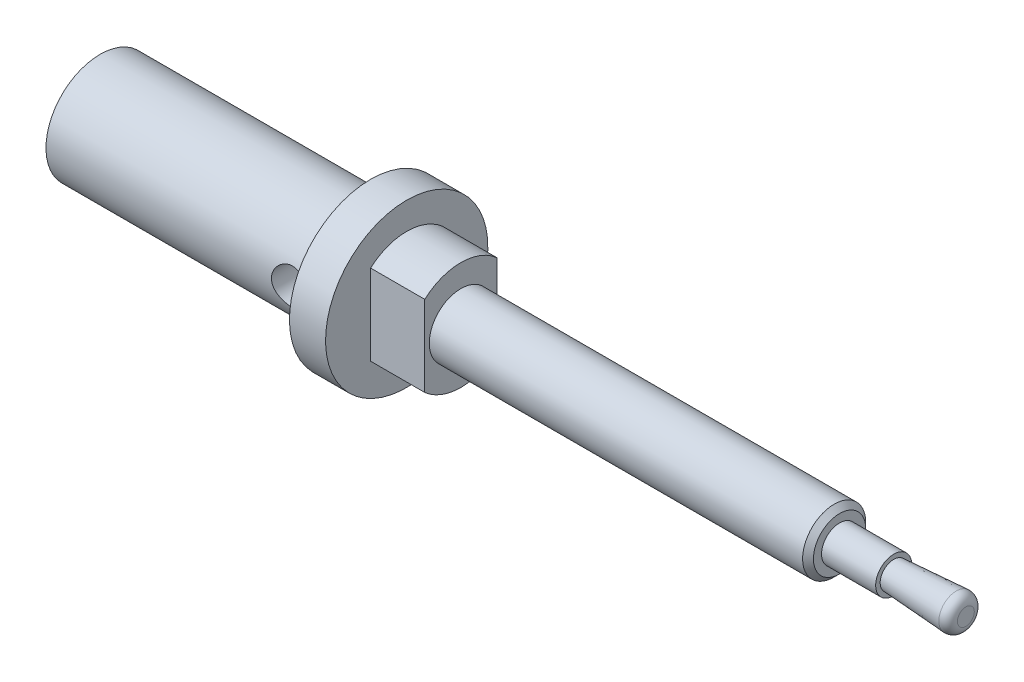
ISO-10303-21;
HEADER;
FILE_DESCRIPTION(('STEP AP214'),'2;1');
FILE_NAME('part.step','',(''),(''),'','','');
FILE_SCHEMA(('AUTOMOTIVE_DESIGN { 1 0 10303 214 1 1 1 1 }'));
ENDSEC;
DATA;
#1=APPLICATION_CONTEXT('core data for automotive mechanical design processes');
#2=APPLICATION_PROTOCOL_DEFINITION('international standard','automotive_design',2000,#1);
#3=PRODUCT_CONTEXT('',#1,'mechanical');
#4=PRODUCT('Part','Part','',(#3));
#5=PRODUCT_RELATED_PRODUCT_CATEGORY('part','',(#4));
#6=PRODUCT_DEFINITION_FORMATION('','',#4);
#7=PRODUCT_DEFINITION_CONTEXT('part definition',#1,'design');
#8=PRODUCT_DEFINITION('design','',#6,#7);
#9=PRODUCT_DEFINITION_SHAPE('','',#8);
#10=(LENGTH_UNIT() NAMED_UNIT(*) SI_UNIT(.MILLI.,.METRE.));
#11=(NAMED_UNIT(*) PLANE_ANGLE_UNIT() SI_UNIT($,.RADIAN.));
#12=(NAMED_UNIT(*) SI_UNIT($,.STERADIAN.) SOLID_ANGLE_UNIT());
#13=UNCERTAINTY_MEASURE_WITH_UNIT(LENGTH_MEASURE(1.E-05),#10,'distance_accuracy_value','');
#14=(GEOMETRIC_REPRESENTATION_CONTEXT(3) GLOBAL_UNCERTAINTY_ASSIGNED_CONTEXT((#13)) GLOBAL_UNIT_ASSIGNED_CONTEXT((#10,
#11,#12)) REPRESENTATION_CONTEXT('',''));
#15=CARTESIAN_POINT('',(0.,0.,0.));
#16=DIRECTION('',(0.,0.,1.));
#17=DIRECTION('',(1.,0.,0.));
#18=AXIS2_PLACEMENT_3D('',#15,#16,#17);
#19=CARTESIAN_POINT('',(33.,0.,0.));
#20=DIRECTION('',(1.,0.,0.));
#21=DIRECTION('',(0.,0.999999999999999,0.));
#22=AXIS2_PLACEMENT_3D('',#19,#20,#21);
#23=CYLINDRICAL_SURFACE('',#22,3.);
#24=DIRECTION('',(1.,0.,0.));
#25=VECTOR('',#24,1.);
#26=CARTESIAN_POINT('',(-2.58257569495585,-2.23606797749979,-2.));
#27=LINE('',#26,#25);
#28=CARTESIAN_POINT('',(2.,-2.23606797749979,-2.));
#29=VERTEX_POINT('',#28);
#30=CARTESIAN_POINT('',(5.,-2.23606797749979,-2.));
#31=VERTEX_POINT('',#30);
#32=EDGE_CURVE('E109',#29,#31,#27,.T.);
#33=ORIENTED_EDGE('',*,*,#32,.T.);
#34=CARTESIAN_POINT('',(5.,0.,0.));
#35=DIRECTION('',(1.,0.,0.));
#36=DIRECTION('',(0.,0.999999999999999,0.));
#37=AXIS2_PLACEMENT_3D('',#34,#35,#36);
#38=CIRCLE('',#37,3.);
#39=CARTESIAN_POINT('',(5.,-2.23606797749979,2.));
#40=VERTEX_POINT('',#39);
#41=EDGE_CURVE('E136',#40,#31,#38,.T.);
#42=ORIENTED_EDGE('',*,*,#41,.F.);
#43=DIRECTION('',(1.,0.,0.));
#44=VECTOR('',#43,1.);
#45=CARTESIAN_POINT('',(-2.58257569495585,-2.23606797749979,2.));
#46=LINE('',#45,#44);
#47=CARTESIAN_POINT('',(2.,-2.23606797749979,2.));
#48=VERTEX_POINT('',#47);
#49=EDGE_CURVE('E70',#48,#40,#46,.T.);
#50=ORIENTED_EDGE('',*,*,#49,.F.);
#51=CARTESIAN_POINT('',(2.,0.,0.));
#52=DIRECTION('',(1.,0.,0.));
#53=DIRECTION('',(0.,0.999999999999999,0.));
#54=AXIS2_PLACEMENT_3D('',#51,#52,#53);
#55=CIRCLE('',#54,3.);
#56=EDGE_CURVE('E140',#48,#29,#55,.T.);
#57=ORIENTED_EDGE('',*,*,#56,.T.);
#58=EDGE_LOOP('',(#33,#42,#50,#57));
#59=FACE_BOUND('',#58,.T.);
#60=ADVANCED_FACE('F42',(#59),#23,.T.);
#61=CARTESIAN_POINT('',(-15.,0.,0.));
#62=DIRECTION('',(-1.,0.,0.));
#63=DIRECTION('',(0.,-0.999999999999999,0.));
#64=AXIS2_PLACEMENT_3D('',#61,#62,#63);
#65=PLANE('',#64);
#66=CARTESIAN_POINT('',(-15.,0.,0.));
#67=DIRECTION('',(-1.,0.,0.));
#68=DIRECTION('',(0.,0.,0.999999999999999));
#69=AXIS2_PLACEMENT_3D('',#66,#67,#68);
#70=CIRCLE('',#69,1.99999999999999);
#71=CARTESIAN_POINT('',(-15.,0.,1.99999999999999));
#72=VERTEX_POINT('',#71);
#73=EDGE_CURVE('E100',#72,#72,#70,.T.);
#74=ORIENTED_EDGE('',*,*,#73,.F.);
#75=EDGE_LOOP('',(#74));
#76=FACE_BOUND('',#75,.T.);
#77=CARTESIAN_POINT('',(-15.,0.,0.));
#78=DIRECTION('',(1.,0.,0.));
#79=DIRECTION('',(0.,0.999999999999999,0.));
#80=AXIS2_PLACEMENT_3D('',#77,#78,#79);
#81=CIRCLE('',#80,3.);
#82=CARTESIAN_POINT('',(-15.,2.99999999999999,0.));
#83=VERTEX_POINT('',#82);
#84=EDGE_CURVE('E152',#83,#83,#81,.T.);
#85=ORIENTED_EDGE('',*,*,#84,.F.);
#86=EDGE_LOOP('',(#85));
#87=FACE_BOUND('',#86,.T.);
#88=ADVANCED_FACE('F44',(#76,#87),#65,.T.);
#89=CARTESIAN_POINT('',(33.,0.,0.));
#90=DIRECTION('',(1.,0.,0.));
#91=DIRECTION('',(0.,0.999999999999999,0.));
#92=AXIS2_PLACEMENT_3D('',#89,#90,#91);
#93=CYLINDRICAL_SURFACE('',#92,3.);
#94=CARTESIAN_POINT('',(-0.5,0.,-3.));
#95=CARTESIAN_POINT('',(-0.499999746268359,-0.0545633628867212,-3.00000015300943));
#96=CARTESIAN_POINT('',(-0.504480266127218,-0.109125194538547,-2.99849769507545));
#97=CARTESIAN_POINT('',(-0.52222910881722,-0.216641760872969,-2.99265210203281));
#98=CARTESIAN_POINT('',(-0.535498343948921,-0.269596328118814,-2.98830867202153));
#99=CARTESIAN_POINT('',(-0.570319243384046,-0.372332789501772,-2.97725307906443));
#100=CARTESIAN_POINT('',(-0.591857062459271,-0.42211982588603,-2.97054487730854));
#101=CARTESIAN_POINT('',(-0.642541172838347,-0.51737493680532,-2.95544445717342));
#102=CARTESIAN_POINT('',(-0.6716889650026,-0.562842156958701,-2.94705190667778));
#103=CARTESIAN_POINT('',(-0.737825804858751,-0.649741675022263,-2.92914094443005));
#104=CARTESIAN_POINT('',(-0.775031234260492,-0.691003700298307,-2.91959556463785));
#105=CARTESIAN_POINT('',(-0.855767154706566,-0.766832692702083,-2.90060314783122));
#106=CARTESIAN_POINT('',(-0.899299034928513,-0.801398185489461,-2.89115613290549));
#107=CARTESIAN_POINT('',(-0.992985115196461,-0.863824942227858,-2.87313332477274));
#108=CARTESIAN_POINT('',(-1.04329373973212,-0.891464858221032,-2.86459039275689));
#109=CARTESIAN_POINT('',(-1.14817609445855,-0.937818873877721,-2.84975305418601));
#110=CARTESIAN_POINT('',(-1.20274851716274,-0.956535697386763,-2.84345796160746));
#111=CARTESIAN_POINT('',(-1.31267322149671,-0.983873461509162,-2.83411303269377));
#112=CARTESIAN_POINT('',(-1.36793720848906,-0.992813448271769,-2.83096095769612));
#113=CARTESIAN_POINT('',(-1.47926375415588,-1.00134112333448,-2.82795656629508));
#114=CARTESIAN_POINT('',(-1.53532606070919,-1.00093170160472,-2.8281032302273));
#115=CARTESIAN_POINT('',(-1.64393663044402,-0.991019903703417,-2.8315901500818));
#116=CARTESIAN_POINT('',(-1.69652840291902,-0.981933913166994,-2.83478415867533));
#117=CARTESIAN_POINT('',(-1.79939341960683,-0.955606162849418,-2.84376657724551));
#118=CARTESIAN_POINT('',(-1.84966638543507,-0.938363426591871,-2.84955529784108));
#119=CARTESIAN_POINT('',(-1.94741274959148,-0.895939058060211,-2.86317911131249));
#120=CARTESIAN_POINT('',(-1.99482802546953,-0.870634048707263,-2.87104565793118));
#121=CARTESIAN_POINT('',(-2.08487090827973,-0.812889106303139,-2.88792558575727));
#122=CARTESIAN_POINT('',(-2.12749712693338,-0.780447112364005,-2.89693929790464));
#123=CARTESIAN_POINT('',(-2.20909159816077,-0.707349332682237,-2.91567329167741));
#124=CARTESIAN_POINT('',(-2.24775269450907,-0.666353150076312,-2.92540589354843));
#125=CARTESIAN_POINT('',(-2.3177312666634,-0.578339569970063,-2.94406938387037));
#126=CARTESIAN_POINT('',(-2.3490480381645,-0.531321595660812,-2.95300019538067));
#127=CARTESIAN_POINT('',(-2.40369630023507,-0.431947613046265,-2.96917107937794));
#128=CARTESIAN_POINT('',(-2.42694549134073,-0.379543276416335,-2.9763935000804));
#129=CARTESIAN_POINT('',(-2.46420317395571,-0.271269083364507,-2.98820567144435));
#130=CARTESIAN_POINT('',(-2.47821487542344,-0.215400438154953,-2.99279633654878));
#131=CARTESIAN_POINT('',(-2.49605566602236,-0.104383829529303,-2.99867627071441));
#132=CARTESIAN_POINT('',(-2.50029980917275,-0.049309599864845,-3.00010001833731));
#133=CARTESIAN_POINT('',(-2.49966732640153,0.0607750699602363,-2.99988902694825));
#134=CARTESIAN_POINT('',(-2.49479224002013,0.115785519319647,-2.99825480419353));
#135=CARTESIAN_POINT('',(-2.47638809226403,0.222519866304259,-2.99220024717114));
#136=CARTESIAN_POINT('',(-2.46311379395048,0.274292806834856,-2.98786198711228));
#137=CARTESIAN_POINT('',(-2.4286065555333,0.374855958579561,-2.97691846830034));
#138=CARTESIAN_POINT('',(-2.40737260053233,0.423645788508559,-2.97031292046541));
#139=CARTESIAN_POINT('',(-2.3569295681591,0.518288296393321,-2.95528931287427));
#140=CARTESIAN_POINT('',(-2.3275254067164,0.56402995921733,-2.94682814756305));
#141=CARTESIAN_POINT('',(-2.26180584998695,0.650064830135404,-2.92905253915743));
#142=CARTESIAN_POINT('',(-2.22548834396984,0.690356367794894,-2.91973783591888));
#143=CARTESIAN_POINT('',(-2.14502124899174,0.766252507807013,-2.90076847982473));
#144=CARTESIAN_POINT('',(-2.10059077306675,0.801560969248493,-2.89111761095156));
#145=CARTESIAN_POINT('',(-2.0062284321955,0.864257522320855,-2.87299973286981));
#146=CARTESIAN_POINT('',(-1.9562965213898,0.891645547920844,-2.8645327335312));
#147=CARTESIAN_POINT('',(-1.8523269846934,0.93759693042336,-2.84982391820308));
#148=CARTESIAN_POINT('',(-1.79829792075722,0.956178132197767,-2.84357760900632));
#149=CARTESIAN_POINT('',(-1.68762134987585,0.983894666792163,-2.83410832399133));
#150=CARTESIAN_POINT('',(-1.63097503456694,0.993034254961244,-2.83088398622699));
#151=CARTESIAN_POINT('',(-1.51980290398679,1.00127628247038,-2.82797858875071));
#152=CARTESIAN_POINT('',(-1.46531765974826,1.00087025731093,-2.82812400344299));
#153=CARTESIAN_POINT('',(-1.35723492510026,0.991242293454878,-2.8315126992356));
#154=CARTESIAN_POINT('',(-1.30363738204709,0.982020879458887,-2.83475579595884));
#155=CARTESIAN_POINT('',(-1.19986433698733,0.95537181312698,-2.84384524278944));
#156=CARTESIAN_POINT('',(-1.14964317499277,0.938103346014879,-2.84964098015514));
#157=CARTESIAN_POINT('',(-1.05277259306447,0.895979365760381,-2.86316398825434));
#158=CARTESIAN_POINT('',(-1.00612396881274,0.871122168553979,-2.87089168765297));
#159=CARTESIAN_POINT('',(-0.915516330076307,0.813260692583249,-2.8878282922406));
#160=CARTESIAN_POINT('',(-0.871763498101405,0.779948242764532,-2.89708711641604));
#161=CARTESIAN_POINT('',(-0.79031018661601,0.706642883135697,-2.91583356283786));
#162=CARTESIAN_POINT('',(-0.752611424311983,0.666648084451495,-2.92532124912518));
#163=CARTESIAN_POINT('',(-0.682855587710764,0.579241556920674,-2.94390030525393));
#164=CARTESIAN_POINT('',(-0.651075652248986,0.531601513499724,-2.95296181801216));
#165=CARTESIAN_POINT('',(-0.596009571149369,0.431357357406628,-2.96925991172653));
#166=CARTESIAN_POINT('',(-0.572721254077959,0.378754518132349,-2.97649695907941));
#167=CARTESIAN_POINT('',(-0.536278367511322,0.272493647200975,-2.98805515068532));
#168=CARTESIAN_POINT('',(-0.522717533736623,0.218987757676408,-2.9924921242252));
#169=CARTESIAN_POINT('',(-0.504579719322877,0.110320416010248,-2.99846407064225));
#170=CARTESIAN_POINT('',(-0.500000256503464,0.0551594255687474,-2.99999984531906));
#171=CARTESIAN_POINT('',(-0.5,0.,-3.));
#172=B_SPLINE_CURVE_WITH_KNOTS('',3,(#94,#95,#96,#97,#98,#99,#100,#101,#102,#103,#104,#105,#106,
#107,#108,#109,#110,#111,#112,#113,#114,#115,#116,#117,#118,#119,#120,#121,#122,#123,#124,#125,
#126,#127,#128,#129,#130,#131,#132,#133,#134,#135,#136,#137,#138,#139,#140,#141,#142,#143,#144,
#145,#146,#147,#148,#149,#150,#151,#152,#153,#154,#155,#156,#157,#158,#159,#160,#161,#162,#163,
#164,#165,#166,#167,#168,#169,#170,#171),.UNSPECIFIED.,.T.,.F.,(4,2,2,2,2,2,2,2,2,2,2,2,2,2,2,2,
2,2,2,2,2,2,2,2,2,2,2,2,2,2,2,2,2,2,2,2,2,2,4),(0.,0.16348710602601,0.326991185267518,
0.49022267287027,0.653486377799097,0.821846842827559,0.990244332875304,1.16348384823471,
1.33667044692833,1.5040192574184,1.67131633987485,1.8309682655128,1.99063930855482,
2.15288171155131,2.31517102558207,2.48593305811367,2.65671145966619,2.82918405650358,
3.00159668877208,3.1665358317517,3.33144713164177,3.49158157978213,3.65173645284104,
3.81610399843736,3.98052180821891,4.15241022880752,4.32430008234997,4.49584013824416,
4.66730284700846,4.82995666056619,4.99260079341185,5.15215587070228,5.31174638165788,
5.47830066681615,5.64490211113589,5.81799660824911,5.99104681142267,6.15636558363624,
6.3216386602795),.UNSPECIFIED.);
#173=CARTESIAN_POINT('',(-0.5,0.,-3.));
#174=VERTEX_POINT('',#173);
#175=EDGE_CURVE('E46',#174,#174,#172,.T.);
#176=ORIENTED_EDGE('',*,*,#175,.F.);
#177=EDGE_LOOP('',(#176));
#178=FACE_BOUND('',#177,.T.);
#179=CARTESIAN_POINT('',(-0.5,0.,3.));
#180=CARTESIAN_POINT('',(-0.49999974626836,0.0545633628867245,3.00000015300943));
#181=CARTESIAN_POINT('',(-0.504480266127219,0.109125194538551,2.99849769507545));
#182=CARTESIAN_POINT('',(-0.52222910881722,0.216641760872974,2.99265210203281));
#183=CARTESIAN_POINT('',(-0.535498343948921,0.26959632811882,2.98830867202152));
#184=CARTESIAN_POINT('',(-0.570319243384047,0.372332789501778,2.97725307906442));
#185=CARTESIAN_POINT('',(-0.591857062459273,0.422119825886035,2.97054487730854));
#186=CARTESIAN_POINT('',(-0.642541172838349,0.517374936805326,2.95544445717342));
#187=CARTESIAN_POINT('',(-0.6716889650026,0.562842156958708,2.94705190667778));
#188=CARTESIAN_POINT('',(-0.737825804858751,0.649741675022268,2.92914094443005));
#189=CARTESIAN_POINT('',(-0.775031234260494,0.69100370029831,2.91959556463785));
#190=CARTESIAN_POINT('',(-0.855767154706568,0.766832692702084,2.90060314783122));
#191=CARTESIAN_POINT('',(-0.899299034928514,0.801398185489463,2.89115613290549));
#192=CARTESIAN_POINT('',(-0.992985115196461,0.863824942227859,2.87313332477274));
#193=CARTESIAN_POINT('',(-1.04329373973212,0.891464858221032,2.86459039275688));
#194=CARTESIAN_POINT('',(-1.14817609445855,0.937818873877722,2.84975305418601));
#195=CARTESIAN_POINT('',(-1.20274851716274,0.956535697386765,2.84345796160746));
#196=CARTESIAN_POINT('',(-1.31267322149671,0.983873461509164,2.83411303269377));
#197=CARTESIAN_POINT('',(-1.36793720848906,0.992813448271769,2.83096095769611));
#198=CARTESIAN_POINT('',(-1.47926375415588,1.00134112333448,2.82795656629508));
#199=CARTESIAN_POINT('',(-1.53532606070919,1.00093170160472,2.8281032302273));
#200=CARTESIAN_POINT('',(-1.64393663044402,0.991019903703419,2.8315901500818));
#201=CARTESIAN_POINT('',(-1.69652840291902,0.981933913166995,2.83478415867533));
#202=CARTESIAN_POINT('',(-1.79939341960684,0.955606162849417,2.84376657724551));
#203=CARTESIAN_POINT('',(-1.84966638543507,0.938363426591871,2.84955529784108));
#204=CARTESIAN_POINT('',(-1.94741274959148,0.895939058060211,2.86317911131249));
#205=CARTESIAN_POINT('',(-1.99482802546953,0.870634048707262,2.87104565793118));
#206=CARTESIAN_POINT('',(-2.08487090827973,0.812889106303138,2.88792558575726));
#207=CARTESIAN_POINT('',(-2.12749712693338,0.780447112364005,2.89693929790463));
#208=CARTESIAN_POINT('',(-2.20909159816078,0.707349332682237,2.91567329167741));
#209=CARTESIAN_POINT('',(-2.24775269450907,0.666353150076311,2.92540589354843));
#210=CARTESIAN_POINT('',(-2.3177312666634,0.578339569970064,2.94406938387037));
#211=CARTESIAN_POINT('',(-2.3490480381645,0.531321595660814,2.95300019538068));
#212=CARTESIAN_POINT('',(-2.40369630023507,0.431947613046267,2.96917107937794));
#213=CARTESIAN_POINT('',(-2.42694549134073,0.379543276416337,2.9763935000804));
#214=CARTESIAN_POINT('',(-2.46420317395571,0.271269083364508,2.98820567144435));
#215=CARTESIAN_POINT('',(-2.47821487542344,0.215400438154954,2.99279633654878));
#216=CARTESIAN_POINT('',(-2.49605566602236,0.104383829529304,2.99867627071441));
#217=CARTESIAN_POINT('',(-2.50029980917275,0.0493095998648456,3.00010001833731));
#218=CARTESIAN_POINT('',(-2.49966732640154,-0.060775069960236,2.99988902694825));
#219=CARTESIAN_POINT('',(-2.49479224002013,-0.115785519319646,2.99825480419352));
#220=CARTESIAN_POINT('',(-2.47638809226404,-0.222519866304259,2.99220024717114));
#221=CARTESIAN_POINT('',(-2.46311379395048,-0.274292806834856,2.98786198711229));
#222=CARTESIAN_POINT('',(-2.4286065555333,-0.374855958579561,2.97691846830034));
#223=CARTESIAN_POINT('',(-2.40737260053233,-0.423645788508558,2.97031292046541));
#224=CARTESIAN_POINT('',(-2.3569295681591,-0.518288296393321,2.95528931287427));
#225=CARTESIAN_POINT('',(-2.3275254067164,-0.564029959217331,2.94682814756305));
#226=CARTESIAN_POINT('',(-2.26180584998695,-0.650064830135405,2.92905253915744));
#227=CARTESIAN_POINT('',(-2.22548834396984,-0.690356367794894,2.91973783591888));
#228=CARTESIAN_POINT('',(-2.14502124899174,-0.766252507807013,2.90076847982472));
#229=CARTESIAN_POINT('',(-2.10059077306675,-0.801560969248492,2.89111761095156));
#230=CARTESIAN_POINT('',(-2.0062284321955,-0.864257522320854,2.87299973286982));
#231=CARTESIAN_POINT('',(-1.9562965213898,-0.891645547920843,2.8645327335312));
#232=CARTESIAN_POINT('',(-1.85232698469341,-0.93759693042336,2.84982391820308));
#233=CARTESIAN_POINT('',(-1.79829792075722,-0.956178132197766,2.84357760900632));
#234=CARTESIAN_POINT('',(-1.68762134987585,-0.983894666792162,2.83410832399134));
#235=CARTESIAN_POINT('',(-1.63097503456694,-0.993034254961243,2.83088398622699));
#236=CARTESIAN_POINT('',(-1.51980290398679,-1.00127628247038,2.82797858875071));
#237=CARTESIAN_POINT('',(-1.46531765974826,-1.00087025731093,2.828124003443));
#238=CARTESIAN_POINT('',(-1.35723492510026,-0.991242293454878,2.83151269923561));
#239=CARTESIAN_POINT('',(-1.30363738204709,-0.982020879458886,2.83475579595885));
#240=CARTESIAN_POINT('',(-1.19986433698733,-0.95537181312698,2.84384524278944));
#241=CARTESIAN_POINT('',(-1.14964317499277,-0.93810334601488,2.84964098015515));
#242=CARTESIAN_POINT('',(-1.05277259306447,-0.895979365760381,2.86316398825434));
#243=CARTESIAN_POINT('',(-1.00612396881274,-0.871122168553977,2.87089168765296));
#244=CARTESIAN_POINT('',(-0.91551633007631,-0.813260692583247,2.8878282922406));
#245=CARTESIAN_POINT('',(-0.871763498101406,-0.779948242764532,2.89708711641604));
#246=CARTESIAN_POINT('',(-0.79031018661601,-0.706642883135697,2.91583356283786));
#247=CARTESIAN_POINT('',(-0.752611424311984,-0.666648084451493,2.92532124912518));
#248=CARTESIAN_POINT('',(-0.682855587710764,-0.579241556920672,2.94390030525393));
#249=CARTESIAN_POINT('',(-0.651075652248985,-0.531601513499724,2.95296181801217));
#250=CARTESIAN_POINT('',(-0.596009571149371,-0.431357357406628,2.96925991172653));
#251=CARTESIAN_POINT('',(-0.572721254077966,-0.378754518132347,2.9764969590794));
#252=CARTESIAN_POINT('',(-0.536278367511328,-0.272493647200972,2.98805515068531));
#253=CARTESIAN_POINT('',(-0.522717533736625,-0.218987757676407,2.9924921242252));
#254=CARTESIAN_POINT('',(-0.504579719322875,-0.110320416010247,2.99846407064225));
#255=CARTESIAN_POINT('',(-0.500000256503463,-0.0551594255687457,2.99999984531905));
#256=CARTESIAN_POINT('',(-0.5,0.,3.));
#257=B_SPLINE_CURVE_WITH_KNOTS('',3,(#179,#180,#181,#182,#183,#184,#185,#186,#187,#188,#189,
#190,#191,#192,#193,#194,#195,#196,#197,#198,#199,#200,#201,#202,#203,#204,#205,#206,#207,#208,
#209,#210,#211,#212,#213,#214,#215,#216,#217,#218,#219,#220,#221,#222,#223,#224,#225,#226,#227,
#228,#229,#230,#231,#232,#233,#234,#235,#236,#237,#238,#239,#240,#241,#242,#243,#244,#245,#246,
#247,#248,#249,#250,#251,#252,#253,#254,#255,#256),.UNSPECIFIED.,.T.,.F.,(4,2,2,2,2,2,2,2,2,2,2,
2,2,2,2,2,2,2,2,2,2,2,2,2,2,2,2,2,2,2,2,2,2,2,2,2,2,2,4),(0.,0.163487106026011,
0.326991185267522,0.490222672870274,0.6534863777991,0.82184684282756,0.990244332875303,
1.1634838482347,1.33667044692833,1.5040192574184,1.67131633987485,1.8309682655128,
1.99063930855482,2.15288171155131,2.31517102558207,2.48593305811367,2.65671145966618,
2.82918405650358,3.00159668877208,3.1665358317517,3.33144713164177,3.49158157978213,
3.65173645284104,3.81610399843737,3.98052180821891,4.15241022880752,4.32430008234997,
4.49584013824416,4.66730284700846,4.82995666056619,4.99260079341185,5.15215587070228,
5.31174638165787,5.47830066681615,5.64490211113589,5.81799660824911,5.99104681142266,
6.15636558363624,6.3216386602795),.UNSPECIFIED.);
#258=CARTESIAN_POINT('',(-0.5,0.,3.));
#259=VERTEX_POINT('',#258);
#260=EDGE_CURVE('E106',#259,#259,#257,.T.);
#261=ORIENTED_EDGE('',*,*,#260,.F.);
#262=EDGE_LOOP('',(#261));
#263=FACE_BOUND('',#262,.T.);
#264=ORIENTED_EDGE('',*,*,#84,.T.);
#265=EDGE_LOOP('',(#264));
#266=FACE_BOUND('',#265,.T.);
#267=CARTESIAN_POINT('',(0.,0.,0.));
#268=DIRECTION('',(1.,0.,0.));
#269=DIRECTION('',(0.,0.999999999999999,0.));
#270=AXIS2_PLACEMENT_3D('',#267,#268,#269);
#271=CIRCLE('',#270,3.);
#272=CARTESIAN_POINT('',(0.,2.99999999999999,0.));
#273=VERTEX_POINT('',#272);
#274=EDGE_CURVE('E149',#273,#273,#271,.T.);
#275=ORIENTED_EDGE('',*,*,#274,.F.);
#276=EDGE_LOOP('',(#275));
#277=FACE_BOUND('',#276,.T.);
#278=ADVANCED_FACE('F165',(#178,#263,#266,#277),#93,.T.);
#279=CARTESIAN_POINT('',(0.,3.,0.));
#280=DIRECTION('',(-1.,0.,0.));
#281=DIRECTION('',(0.,-0.999999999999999,0.));
#282=AXIS2_PLACEMENT_3D('',#279,#280,#281);
#283=PLANE('',#282);
#284=ORIENTED_EDGE('',*,*,#274,.T.);
#285=EDGE_LOOP('',(#284));
#286=FACE_BOUND('',#285,.T.);
#287=CARTESIAN_POINT('',(0.,0.,0.));
#288=DIRECTION('',(1.,0.,0.));
#289=DIRECTION('',(0.,0.999999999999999,0.));
#290=AXIS2_PLACEMENT_3D('',#287,#288,#289);
#291=CIRCLE('',#290,4.5);
#292=CARTESIAN_POINT('',(0.,4.49999999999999,0.));
#293=VERTEX_POINT('',#292);
#294=EDGE_CURVE('E146',#293,#293,#291,.T.);
#295=ORIENTED_EDGE('',*,*,#294,.F.);
#296=EDGE_LOOP('',(#295));
#297=FACE_BOUND('',#296,.T.);
#298=ADVANCED_FACE('F227',(#286,#297),#283,.T.);
#299=CARTESIAN_POINT('',(33.,0.,0.));
#300=DIRECTION('',(1.,0.,0.));
#301=DIRECTION('',(0.,0.999999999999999,0.));
#302=AXIS2_PLACEMENT_3D('',#299,#300,#301);
#303=CYLINDRICAL_SURFACE('',#302,4.5);
#304=ORIENTED_EDGE('',*,*,#294,.T.);
#305=EDGE_LOOP('',(#304));
#306=FACE_BOUND('',#305,.T.);
#307=CARTESIAN_POINT('',(2.,0.,0.));
#308=DIRECTION('',(1.,0.,0.));
#309=DIRECTION('',(0.,0.999999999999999,0.));
#310=AXIS2_PLACEMENT_3D('',#307,#308,#309);
#311=CIRCLE('',#310,4.5);
#312=CARTESIAN_POINT('',(2.,4.49999999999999,0.));
#313=VERTEX_POINT('',#312);
#314=EDGE_CURVE('E143',#313,#313,#311,.T.);
#315=ORIENTED_EDGE('',*,*,#314,.F.);
#316=EDGE_LOOP('',(#315));
#317=FACE_BOUND('',#316,.T.);
#318=ADVANCED_FACE('F224',(#306,#317),#303,.T.);
#319=CARTESIAN_POINT('',(2.,4.5,0.));
#320=DIRECTION('',(1.,0.,0.));
#321=DIRECTION('',(0.,0.999999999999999,0.));
#322=AXIS2_PLACEMENT_3D('',#319,#320,#321);
#323=PLANE('',#322);
#324=ORIENTED_EDGE('',*,*,#314,.T.);
#325=EDGE_LOOP('',(#324));
#326=FACE_BOUND('',#325,.T.);
#327=ORIENTED_EDGE('',*,*,#56,.F.);
#328=DIRECTION('',(0.,-0.999999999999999,0.));
#329=VECTOR('',#328,1.);
#330=CARTESIAN_POINT('',(2.,-2.23606797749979,2.));
#331=LINE('',#330,#329);
#332=CARTESIAN_POINT('',(2.,2.2360679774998,2.));
#333=VERTEX_POINT('',#332);
#334=EDGE_CURVE('E120',#333,#48,#331,.T.);
#335=ORIENTED_EDGE('',*,*,#334,.F.);
#336=CARTESIAN_POINT('',(2.,2.2360679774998,-2.));
#337=VERTEX_POINT('',#336);
#338=EDGE_CURVE('E139',#337,#333,#55,.T.);
#339=ORIENTED_EDGE('',*,*,#338,.F.);
#340=DIRECTION('',(0.,0.999999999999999,0.));
#341=VECTOR('',#340,1.);
#342=CARTESIAN_POINT('',(2.,-2.23606797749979,-2.));
#343=LINE('',#342,#341);
#344=EDGE_CURVE('E112',#29,#337,#343,.T.);
#345=ORIENTED_EDGE('',*,*,#344,.F.);
#346=EDGE_LOOP('',(#327,#335,#339,#345));
#347=FACE_BOUND('',#346,.T.);
#348=ADVANCED_FACE('F220',(#326,#347),#323,.T.);
#349=DIRECTION('',(1.,0.,0.));
#350=VECTOR('',#349,1.);
#351=CARTESIAN_POINT('',(-2.58257569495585,2.23606797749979,-2.));
#352=LINE('',#351,#350);
#353=CARTESIAN_POINT('',(5.,2.23606797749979,-2.));
#354=VERTEX_POINT('',#353);
#355=EDGE_CURVE('E62',#337,#354,#352,.T.);
#356=ORIENTED_EDGE('',*,*,#355,.F.);
#357=ORIENTED_EDGE('',*,*,#338,.T.);
#358=DIRECTION('',(1.,0.,0.));
#359=VECTOR('',#358,1.);
#360=CARTESIAN_POINT('',(-2.58257569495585,2.23606797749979,2.));
#361=LINE('',#360,#359);
#362=CARTESIAN_POINT('',(5.,2.2360679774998,2.));
#363=VERTEX_POINT('',#362);
#364=EDGE_CURVE('E117',#333,#363,#361,.T.);
#365=ORIENTED_EDGE('',*,*,#364,.T.);
#366=EDGE_CURVE('E135',#354,#363,#38,.T.);
#367=ORIENTED_EDGE('',*,*,#366,.F.);
#368=EDGE_LOOP('',(#356,#357,#365,#367));
#369=FACE_BOUND('',#368,.T.);
#370=ADVANCED_FACE('F216',(#369),#23,.T.);
#371=CARTESIAN_POINT('',(5.,3.,0.));
#372=DIRECTION('',(1.,0.,0.));
#373=DIRECTION('',(0.,0.999999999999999,0.));
#374=AXIS2_PLACEMENT_3D('',#371,#372,#373);
#375=PLANE('',#374);
#376=DIRECTION('',(0.,-0.999999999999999,0.));
#377=VECTOR('',#376,1.);
#378=CARTESIAN_POINT('',(5.,-2.23606797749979,-2.));
#379=LINE('',#378,#377);
#380=EDGE_CURVE('E103',#354,#31,#379,.T.);
#381=ORIENTED_EDGE('',*,*,#380,.F.);
#382=ORIENTED_EDGE('',*,*,#366,.T.);
#383=DIRECTION('',(0.,0.999999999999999,0.));
#384=VECTOR('',#383,1.);
#385=CARTESIAN_POINT('',(5.,-2.23606797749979,2.));
#386=LINE('',#385,#384);
#387=EDGE_CURVE('E115',#40,#363,#386,.T.);
#388=ORIENTED_EDGE('',*,*,#387,.F.);
#389=ORIENTED_EDGE('',*,*,#41,.T.);
#390=EDGE_LOOP('',(#381,#382,#388,#389));
#391=FACE_BOUND('',#390,.T.);
#392=CARTESIAN_POINT('',(5.,0.,0.));
#393=DIRECTION('',(1.,0.,0.));
#394=DIRECTION('',(0.,0.999999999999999,0.));
#395=AXIS2_PLACEMENT_3D('',#392,#393,#394);
#396=CIRCLE('',#395,1.75);
#397=CARTESIAN_POINT('',(5.,1.75,0.));
#398=VERTEX_POINT('',#397);
#399=EDGE_CURVE('E132',#398,#398,#396,.T.);
#400=ORIENTED_EDGE('',*,*,#399,.F.);
#401=EDGE_LOOP('',(#400));
#402=FACE_BOUND('',#401,.T.);
#403=ADVANCED_FACE('F212',(#391,#402),#375,.T.);
#404=CARTESIAN_POINT('',(33.,0.,0.));
#405=DIRECTION('',(1.,0.,0.));
#406=DIRECTION('',(0.,0.999999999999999,0.));
#407=AXIS2_PLACEMENT_3D('',#404,#405,#406);
#408=CYLINDRICAL_SURFACE('',#407,1.75);
#409=CARTESIAN_POINT('',(25.7,0.,0.));
#410=DIRECTION('',(1.,0.,0.));
#411=DIRECTION('',(0.,0.999999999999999,0.));
#412=AXIS2_PLACEMENT_3D('',#409,#410,#411);
#413=CIRCLE('',#412,1.75);
#414=CARTESIAN_POINT('',(25.7,1.75,0.));
#415=VERTEX_POINT('',#414);
#416=EDGE_CURVE('E13',#415,#415,#413,.F.);
#417=ORIENTED_EDGE('',*,*,#416,.T.);
#418=EDGE_LOOP('',(#417));
#419=FACE_BOUND('',#418,.T.);
#420=ORIENTED_EDGE('',*,*,#399,.T.);
#421=EDGE_LOOP('',(#420));
#422=FACE_BOUND('',#421,.T.);
#423=ADVANCED_FACE('F208',(#419,#422),#408,.T.);
#424=CARTESIAN_POINT('',(26.,1.75,0.));
#425=DIRECTION('',(1.,0.,0.));
#426=DIRECTION('',(0.,0.999999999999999,0.));
#427=AXIS2_PLACEMENT_3D('',#424,#425,#426);
#428=PLANE('',#427);
#429=CARTESIAN_POINT('',(26.,0.,0.));
#430=DIRECTION('',(1.,0.,0.));
#431=DIRECTION('',(0.,0.999999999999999,0.));
#432=AXIS2_PLACEMENT_3D('',#429,#430,#431);
#433=CIRCLE('',#432,1.45);
#434=CARTESIAN_POINT('',(26.,1.45,0.));
#435=VERTEX_POINT('',#434);
#436=EDGE_CURVE('E54',#435,#435,#433,.T.);
#437=ORIENTED_EDGE('',*,*,#436,.T.);
#438=EDGE_LOOP('',(#437));
#439=FACE_BOUND('',#438,.T.);
#440=CARTESIAN_POINT('',(26.,0.,0.));
#441=DIRECTION('',(1.,0.,0.));
#442=DIRECTION('',(0.,0.999999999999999,0.));
#443=AXIS2_PLACEMENT_3D('',#440,#441,#442);
#444=CIRCLE('',#443,1.);
#445=CARTESIAN_POINT('',(26.,0.999999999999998,0.));
#446=VERTEX_POINT('',#445);
#447=EDGE_CURVE('E129',#446,#446,#444,.T.);
#448=ORIENTED_EDGE('',*,*,#447,.F.);
#449=EDGE_LOOP('',(#448));
#450=FACE_BOUND('',#449,.T.);
#451=ADVANCED_FACE('F204',(#439,#450),#428,.T.);
#452=CARTESIAN_POINT('',(33.,0.,0.));
#453=DIRECTION('',(1.,0.,0.));
#454=DIRECTION('',(0.,0.999999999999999,0.));
#455=AXIS2_PLACEMENT_3D('',#452,#453,#454);
#456=CYLINDRICAL_SURFACE('',#455,0.999999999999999);
#457=ORIENTED_EDGE('',*,*,#447,.T.);
#458=EDGE_LOOP('',(#457));
#459=FACE_BOUND('',#458,.T.);
#460=CARTESIAN_POINT('',(29.,0.,0.));
#461=DIRECTION('',(1.,0.,0.));
#462=DIRECTION('',(0.,0.999999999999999,0.));
#463=AXIS2_PLACEMENT_3D('',#460,#461,#462);
#464=CIRCLE('',#463,0.999999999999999);
#465=CARTESIAN_POINT('',(29.,0.999999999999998,0.));
#466=VERTEX_POINT('',#465);
#467=EDGE_CURVE('E126',#466,#466,#464,.T.);
#468=ORIENTED_EDGE('',*,*,#467,.F.);
#469=EDGE_LOOP('',(#468));
#470=FACE_BOUND('',#469,.T.);
#471=ADVANCED_FACE('F200',(#459,#470),#456,.T.);
#472=CARTESIAN_POINT('',(29.,0.999999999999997,0.));
#473=DIRECTION('',(1.,0.,0.));
#474=DIRECTION('',(0.,0.999999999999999,0.));
#475=AXIS2_PLACEMENT_3D('',#472,#473,#474);
#476=PLANE('',#475);
#477=ORIENTED_EDGE('',*,*,#467,.T.);
#478=EDGE_LOOP('',(#477));
#479=FACE_BOUND('',#478,.T.);
#480=CARTESIAN_POINT('',(29.,0.,0.));
#481=DIRECTION('',(1.,0.,0.));
#482=DIRECTION('',(0.,0.999999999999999,0.));
#483=AXIS2_PLACEMENT_3D('',#480,#481,#482);
#484=CIRCLE('',#483,0.75);
#485=CARTESIAN_POINT('',(29.,0.749999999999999,0.));
#486=VERTEX_POINT('',#485);
#487=EDGE_CURVE('E123',#486,#486,#484,.T.);
#488=ORIENTED_EDGE('',*,*,#487,.F.);
#489=EDGE_LOOP('',(#488));
#490=FACE_BOUND('',#489,.T.);
#491=ADVANCED_FACE('F196',(#479,#490),#476,.T.);
#492=CARTESIAN_POINT('',(33.,0.,0.));
#493=DIRECTION('',(1.,0.,0.));
#494=DIRECTION('',(0.,0.999999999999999,0.));
#495=AXIS2_PLACEMENT_3D('',#492,#493,#494);
#496=CONICAL_SURFACE('',#495,0.999999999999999,0.0624188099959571);
#497=CARTESIAN_POINT('',(32.4688108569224,0.,0.));
#498=DIRECTION('',(-1.,0.,0.));
#499=DIRECTION('',(0.,-0.999999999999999,0.));
#500=AXIS2_PLACEMENT_3D('',#497,#498,#499);
#501=CIRCLE('',#500,0.96680067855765);
#502=CARTESIAN_POINT('',(32.4688108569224,-0.966800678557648,0.));
#503=VERTEX_POINT('',#502);
#504=EDGE_CURVE('E158',#503,#503,#501,.T.);
#505=ORIENTED_EDGE('',*,*,#504,.T.);
#506=EDGE_LOOP('',(#505));
#507=FACE_BOUND('',#506,.T.);
#508=ORIENTED_EDGE('',*,*,#487,.T.);
#509=EDGE_LOOP('',(#508));
#510=FACE_BOUND('',#509,.T.);
#511=ADVANCED_FACE('F192',(#507,#510),#496,.T.);
#512=CARTESIAN_POINT('',(33.,0.999999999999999,0.));
#513=DIRECTION('',(1.,0.,0.));
#514=DIRECTION('',(0.,0.999999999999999,0.));
#515=AXIS2_PLACEMENT_3D('',#512,#513,#514);
#516=PLANE('',#515);
#517=CARTESIAN_POINT('',(33.,0.,0.));
#518=DIRECTION('',(1.,0.,0.));
#519=DIRECTION('',(0.,0.999999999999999,0.));
#520=AXIS2_PLACEMENT_3D('',#517,#518,#519);
#521=CIRCLE('',#520,0.467774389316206);
#522=CARTESIAN_POINT('',(33.,0.467774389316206,0.));
#523=VERTEX_POINT('',#522);
#524=EDGE_CURVE('E155',#523,#523,#521,.T.);
#525=ORIENTED_EDGE('',*,*,#524,.T.);
#526=EDGE_LOOP('',(#525));
#527=FACE_BOUND('',#526,.T.);
#528=ADVANCED_FACE('F188',(#527),#516,.T.);
#529=CARTESIAN_POINT('',(32.5,0.,0.));
#530=DIRECTION('',(1.,0.,0.));
#531=DIRECTION('',(0.,0.999999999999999,0.));
#532=AXIS2_PLACEMENT_3D('',#529,#530,#531);
#533=DEGENERATE_TOROIDAL_SURFACE('',#532,0.467774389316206,0.5,.T.);
#534=ORIENTED_EDGE('',*,*,#504,.F.);
#535=EDGE_LOOP('',(#534));
#536=FACE_BOUND('',#535,.T.);
#537=ORIENTED_EDGE('',*,*,#524,.F.);
#538=EDGE_LOOP('',(#537));
#539=FACE_BOUND('',#538,.T.);
#540=ADVANCED_FACE('F184',(#536,#539),#533,.T.);
#541=CARTESIAN_POINT('',(26.,0.,0.));
#542=DIRECTION('',(-1.,0.,0.));
#543=DIRECTION('',(0.,-0.999999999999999,0.));
#544=AXIS2_PLACEMENT_3D('',#541,#542,#543);
#545=CONICAL_SURFACE('',#544,1.45,0.785398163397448);
#546=ORIENTED_EDGE('',*,*,#416,.F.);
#547=EDGE_LOOP('',(#546));
#548=FACE_BOUND('',#547,.T.);
#549=ORIENTED_EDGE('',*,*,#436,.F.);
#550=EDGE_LOOP('',(#549));
#551=FACE_BOUND('',#550,.T.);
#552=ADVANCED_FACE('F181',(#548,#551),#545,.T.);
#553=CARTESIAN_POINT('',(-2.58257569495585,-2.23606797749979,2.));
#554=DIRECTION('',(0.,0.,-0.999999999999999));
#555=DIRECTION('',(-1.,0.,0.));
#556=AXIS2_PLACEMENT_3D('',#553,#554,#555);
#557=PLANE('',#556);
#558=ORIENTED_EDGE('',*,*,#334,.T.);
#559=ORIENTED_EDGE('',*,*,#49,.T.);
#560=ORIENTED_EDGE('',*,*,#387,.T.);
#561=ORIENTED_EDGE('',*,*,#364,.F.);
#562=EDGE_LOOP('',(#558,#559,#560,#561));
#563=FACE_BOUND('',#562,.T.);
#564=ADVANCED_FACE('F178',(#563),#557,.F.);
#565=CARTESIAN_POINT('',(-2.58257569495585,-2.23606797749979,-2.));
#566=DIRECTION('',(0.,0.,0.999999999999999));
#567=DIRECTION('',(1.,0.,0.));
#568=AXIS2_PLACEMENT_3D('',#565,#566,#567);
#569=PLANE('',#568);
#570=ORIENTED_EDGE('',*,*,#344,.T.);
#571=ORIENTED_EDGE('',*,*,#355,.T.);
#572=ORIENTED_EDGE('',*,*,#380,.T.);
#573=ORIENTED_EDGE('',*,*,#32,.F.);
#574=EDGE_LOOP('',(#570,#571,#572,#573));
#575=FACE_BOUND('',#574,.T.);
#576=ADVANCED_FACE('F175',(#575),#569,.F.);
#577=CARTESIAN_POINT('',(-15.,0.,0.));
#578=DIRECTION('',(-1.,0.,0.));
#579=DIRECTION('',(0.,0.,0.999999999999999));
#580=AXIS2_PLACEMENT_3D('',#577,#578,#579);
#581=CYLINDRICAL_SURFACE('',#580,1.99999999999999);
#582=CARTESIAN_POINT('',(-5.,0.,0.));
#583=DIRECTION('',(-1.,0.,0.));
#584=DIRECTION('',(0.,0.,0.999999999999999));
#585=AXIS2_PLACEMENT_3D('',#582,#583,#584);
#586=CIRCLE('',#585,1.99999999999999);
#587=CARTESIAN_POINT('',(-5.,0.,1.99999999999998));
#588=VERTEX_POINT('',#587);
#589=EDGE_CURVE('E98',#588,#588,#586,.T.);
#590=ORIENTED_EDGE('',*,*,#589,.F.);
#591=EDGE_LOOP('',(#590));
#592=FACE_BOUND('',#591,.T.);
#593=ORIENTED_EDGE('',*,*,#73,.T.);
#594=EDGE_LOOP('',(#593));
#595=FACE_BOUND('',#594,.T.);
#596=ADVANCED_FACE('F94',(#592,#595),#581,.F.);
#597=CARTESIAN_POINT('',(-5.,0.,0.));
#598=DIRECTION('',(-1.,0.,0.));
#599=DIRECTION('',(0.,0.,0.999999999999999));
#600=AXIS2_PLACEMENT_3D('',#597,#598,#599);
#601=CONICAL_SURFACE('',#600,1.99999999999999,1.02974425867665);
#602=CARTESIAN_POINT('',(-3.79827876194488,0.,0.));
#603=VERTEX_POINT('',#602);
#604=VERTEX_LOOP('',#603);
#605=FACE_BOUND('',#604,.T.);
#606=ORIENTED_EDGE('',*,*,#589,.T.);
#607=EDGE_LOOP('',(#606));
#608=FACE_BOUND('',#607,.T.);
#609=ADVANCED_FACE('F90',(#605,#608),#601,.F.);
#610=CARTESIAN_POINT('',(-1.5,0.,-4.49999999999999));
#611=DIRECTION('',(0.,0.,0.999999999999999));
#612=DIRECTION('',(1.,0.,0.));
#613=AXIS2_PLACEMENT_3D('',#610,#611,#612);
#614=CYLINDRICAL_SURFACE('',#613,1.);
#615=ORIENTED_EDGE('',*,*,#175,.T.);
#616=EDGE_LOOP('',(#615));
#617=FACE_BOUND('',#616,.T.);
#618=ORIENTED_EDGE('',*,*,#260,.T.);
#619=EDGE_LOOP('',(#618));
#620=FACE_BOUND('',#619,.T.);
#621=ADVANCED_FACE('F93',(#617,#620),#614,.F.);
#622=CLOSED_SHELL('',(#60,#88,#278,#298,#318,#348,#370,#403,#423,#451,#471,#491,#511,#528,#540,
#552,#564,#576,#596,#609,#621));
#623=MANIFOLD_SOLID_BREP('B2',#622);
#624=ADVANCED_BREP_SHAPE_REPRESENTATION('',(#18,#623),#14);
#625=SHAPE_DEFINITION_REPRESENTATION(#9,#624);
ENDSEC;
END-ISO-10303-21;
